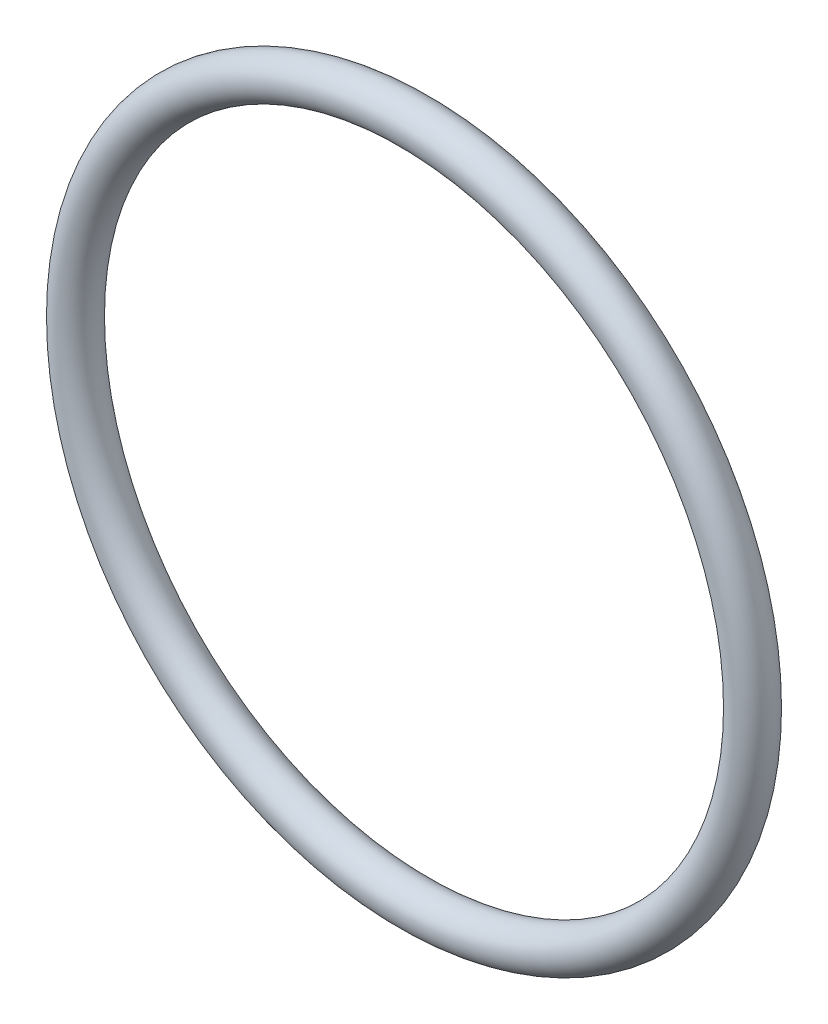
from build123d import *

# Parameters (mm, degrees)
SKETCH1_R = 1


with BuildPart() as part:
    # Sketch1 → Revolve1 (revolve)
    with BuildSketch(Plane(origin=(0, 0, 0), x_dir=(0, 0, -1), z_dir=(1, 0, 0)), mode=Mode.PRIVATE) as revolve1_sk:
        with Locations((1.35878553, 48.170155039)):
            Circle(SKETCH1_R)
    revolve(revolve1_sk.sketch.rotate(Axis((0, 31.670155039, 11.601937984), (0, 0, -1)), 90), axis=Axis((0, 31.670155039, 11.601937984), (0, 0, -1)))


solid = part.part
